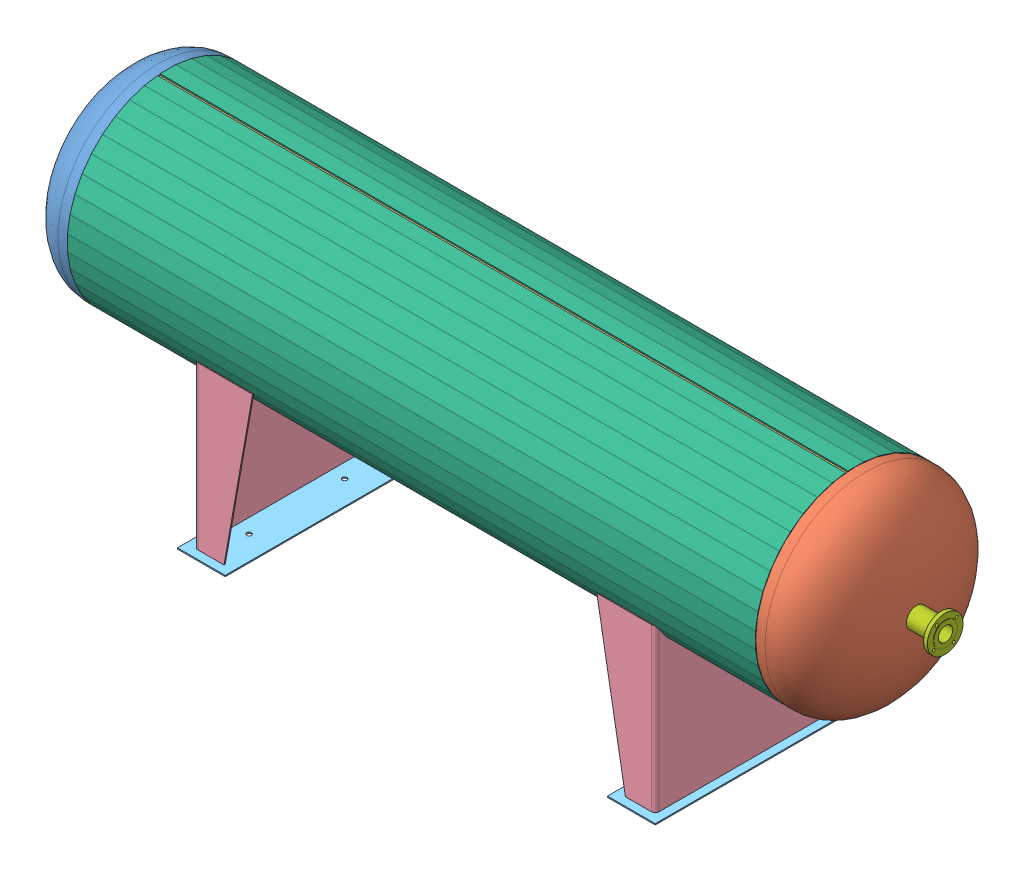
SolidWorks assembly HORIZ VESSEL ELL HEADS-003.SLDASM, configuration Default (file format 13000). Lengths in mm.
Overall size (4467.7 1676.4 1066.8).
9 component instances, 7 part files, 2 mates.
Components (placement in the parent):
- ELL HEAD LE-003-1: ELL HEAD LE-003.sldprt [Default] at origin size (323.85 1066.8 1066.8)
- ELL HEAD RE-003-1: ELL HEAD RE-003.sldprt [Default] at origin size (323.85 1066.8 1066.8)
- Vessel Horizontal-003-1: Vessel Horizontal-003.sldprt [Default] at origin size (3657.6 1066.8 1066.8)
- LEG HV-003-1: LEG HV-003.sldprt [Default] at origin size (310.74 861.92 927.1)
- LEG HV-003-2: LEG HV-003.sldprt [Default] x (-1 0 0) z (0 0 -1) size (310.74 861.92 927.1)
- FOOT HV-003-1: FOOT HV-003.sldprt [Default] at origin size (254 6.35 1016)
- FOOT HV-003-2: FOOT HV-003.sldprt [Default] x (-1 0 0) z (0 0 -1) size (254 6.35 1016)
- VESSEL HORIZ POLYGON-003-1: VESSEL HORIZ POLYGON-003.SLDPRT [Default] x (0 0 1) z (-1 0 0) size (1066.8 1066.8 3745.02) (hidden)
- Long Wide Neck Flange-1: Long Wide Neck Flange.SLDPRT [3 LWN STD 150 X 8in Lg] at (2305.05 0 0) x (-1 0 0) z (0 0.858786 -0.512335) size (223.2 190.5 190.5)
Mates (geometry in assembly coordinates):
- Coincident1: coincident: ELL HEAD RE-003-1, Long Wide Neck Flange-1
- Distance1: distance: ELL HEAD RE-003-1, Long Wide Neck Flange-1
